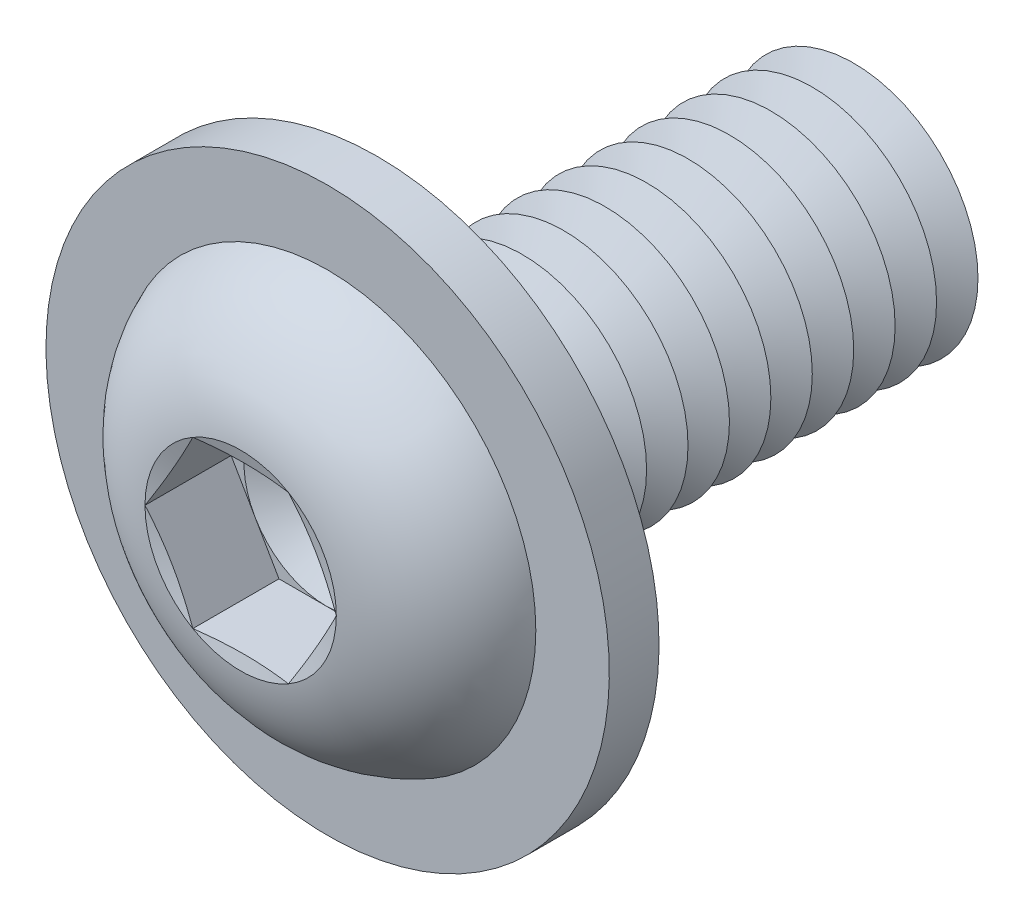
from build123d import *

# Parameters (mm, degrees)
FILLET1_R           = 0.5
LPATTERN1_COUNT     = 12
LPATTERN1_PITCH     = 1
CUT_EXTRUDE1_DEPTH  = 2.08
SKETCH5_R           = 6.8
SKETCH5_R_2         = 3.5
BOSS_EXTRUDE1_DEPTH = 1.2


with BuildPart() as part:
    # Sketch1 → Revolve1 (revolve)
    with BuildSketch(Plane(origin=(0, 0, 0), x_dir=(0, 0, -1), z_dir=(1, 0, 0)), mode=Mode.PRIVATE) as revolve1_sk:
        with BuildLine():
            Line((0, 3), (0, 5.25))
            ThreePointArc((0, 5.25), (-2.210041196, 4.408189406), (-3.3, 2.3094))
            Line((-3.3, 2.3094), (-2.990599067, 1.1547))
            Line((-2.990599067, 1.1547), (-3.3, 1.1547))
            Line((-3.3, 1.1547), (-3.3, 0))
            Line((-3.3, 0), (12, 0))
            Line((12, 0), (12, 3))
            Line((12, 3), (0, 3))
        make_face()
    revolve(revolve1_sk.sketch.rotate(Axis((0, 0, -12), (0, 0, 1)), 90), axis=Axis((0, 0, -12), (0, 0, 1)))

    # Fillet1
    fillet1_edges = [part.edges().sort_by_distance(p)[0] for p in [
        (3, 0, 0),
    ]]
    fillet(fillet1_edges, radius=FILLET1_R)

    # Sketch2 → Cut-Revolve1 (revolve, cut)
    with BuildSketch(Plane(origin=(0, 0, 0), x_dir=(0, 0, -1), z_dir=(1, 0, 0)), mode=Mode.PRIVATE) as cut_revolve1_sk:
        Polygon((11.5, 3), (12.5, 3), (12, 2.133974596), align=None)
    cut_revolve1 = revolve(cut_revolve1_sk.sketch.rotate(Axis((0, 0, -12), (0, 0, -1)), 270), axis=Axis((0, 0, -12), (0, 0, -1)), mode=Mode.SUBTRACT)

    # LPattern1: Cut-Revolve1 ×12
    with Locations(*[(0, 0, i * LPATTERN1_PITCH) for i in range(1, LPATTERN1_COUNT)]):
        add(cut_revolve1, mode=Mode.SUBTRACT)

    # Sketch3 → Cut-Extrude1 (cut)
    with BuildSketch(Plane.XY.offset(3.3)):
        Polygon((1.1547, 1.999999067), (-1.1547, 1.999999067), (-2.3094, 0), (-1.1547, -1.999999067), (1.1547, -1.999999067), (2.3094, 0), align=None)
    extrude(amount=-CUT_EXTRUDE1_DEPTH, mode=Mode.SUBTRACT)

    # Cut-Extrude2 cone 1 section (on through the dimple's axis) → Cut-Extrude2 (revolve, cut)
    with BuildSketch(Plane(origin=(0, 0, 1.22), x_dir=(0, -1, 0), z_dir=(1, 0, 0))):
        Polygon((0, 0), (1.999999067, 0), (0, 1.1547), align=None)
    revolve(axis=Axis((0, 0, 1.22), (0, 0, -1)), mode=Mode.SUBTRACT)

    # Sketch5 → Boss-Extrude1 (add)
    with BuildSketch(Plane(origin=(0, 0, 0), x_dir=(-1, 0, 0), z_dir=(0, 0, -1))):
        with Locations(Location((0, 0, 0), (0, 0, 90))):
            Circle(SKETCH5_R)
        Circle(SKETCH5_R_2, mode=Mode.SUBTRACT)
    extrude(amount=-BOSS_EXTRUDE1_DEPTH)


solid = part.part
